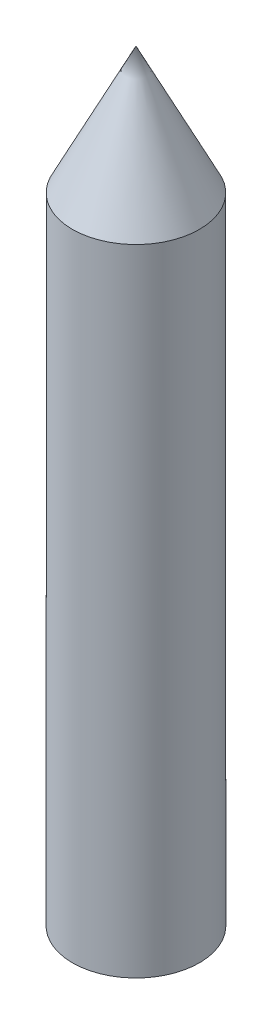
from build123d import *

# Parameters (mm, degrees)
SKETCH1_R           = 5
BOSS_EXTRUDE1_DEPTH = 50


with BuildPart() as part:
    # Sketch1 → Boss-Extrude1 (new body)
    with BuildSketch(Plane(origin=(0, 0, 0), x_dir=(1, 0, 0), z_dir=(0, 1, 0))):
        with Locations(Location((0, 0, 0), (0, 0, 270))):
            Circle(SKETCH1_R)
    extrude(amount=BOSS_EXTRUDE1_DEPTH)

    # Sketch3 → Revolve1 (revolve)
    with BuildSketch(Plane(origin=(0, 0, 0), x_dir=(0, 0, -1), z_dir=(1, 0, 0))):
        Polygon((0, 50), (0, 60), (5, 50), align=None)
    revolve(axis=Axis((0, 50, 0), (0, 1, 0)))


solid = part.part
